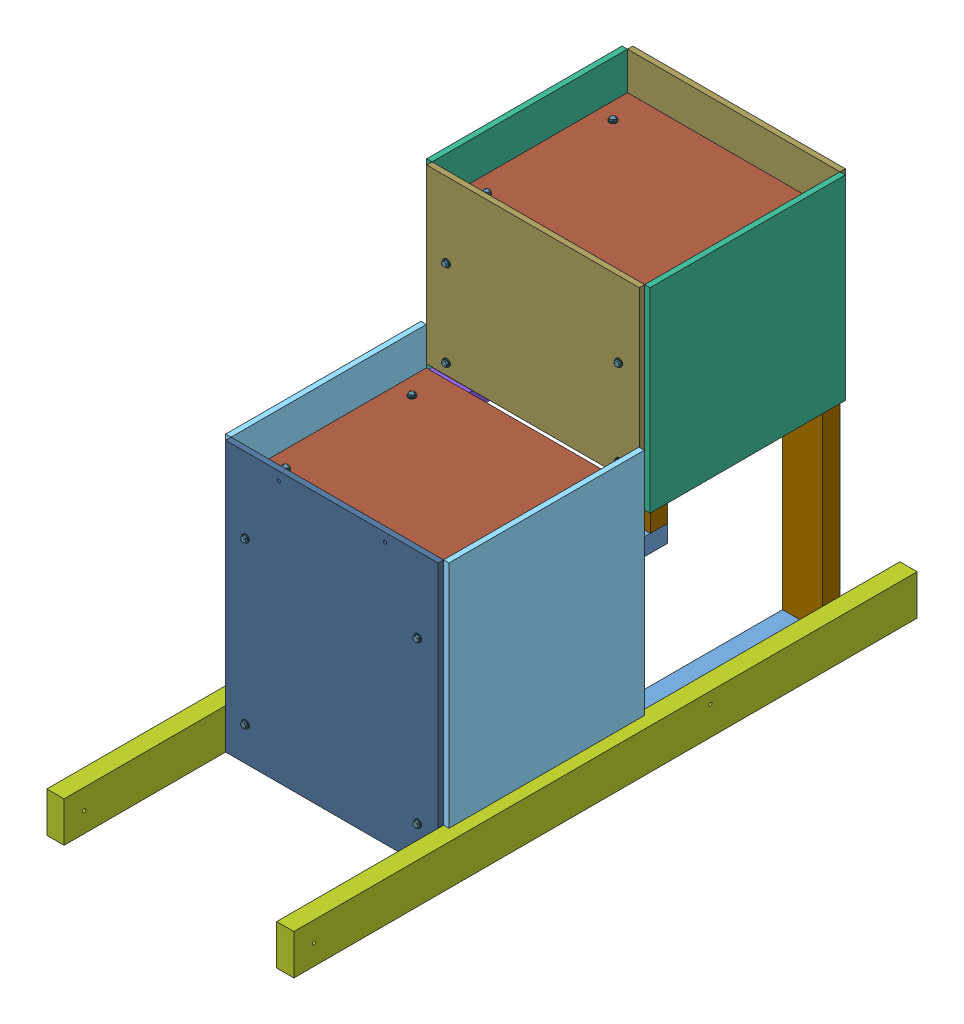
SolidWorks assembly TE-23004.SLDASM, configuration Default (file format 15000). Lengths in mm.
Overall size (546.1 901.7 1377.95).
85 component instances, 15 part files, 174 mates.
Components (placement in the parent):
- TE-23039-1: TE-23039.SLDASM [Default] at (0 0 0.0635) size (127 901.7 1377.95)
  - TE-23018-1: TE-23018.SLDPRT [Default] at (44.45 19.05 -0.0635) x (0 -1 0) z (0 0 1) size (38.1 88.9 876.3)
  - TE-23019-1: TE-23019.SLDPRT [Default] at (44.45 469.9 857.1865) x (0 0 -1) z (0 -1 0) size (38.1 88.9 431.8)
  - TE-23023-1: TE-23023.SLDPRT [Default] at (44.45 793.75 -0.0635) x (0 -1 0) z (0 0 1) size (38.1 88.9 431.8)
  - TE-23022-1: TE-23022.SLDPRT [Default] at (44.45 508 412.6865) x (0 0 1) z (0 1 0) size (38.1 88.9 266.7)
  - TE-23024-1: TE-23024.SLDPRT [Default] at (-11.9062 342.9 660.3365) x (0 0 -1) z (0 -1 0) size (431.8 11.91 508)
  - TE-23025-1: TE-23025.SLDPRT [Default] at (-11.9062 685.8 215.8365) x (0 0 1) z (0 1 0) size (431.8 11.91 431.8)
  - TE-23005-1: TE-23005.SLDPRT [Default] at (-19.05 44.45 -132.6198) size (38.1 88.9 1377.95)
  - TE-23021-1: TE-23021.SLDPRT [Default] at (44.45 488.95 38.0365) x (0 1 0) z (0 0 1) size (38.1 88.9 838.2)
  - TE-23020-1: TE-23020.SLDPRT [Default] at (44.45 38.1 18.9865) x (0 0 -1) z (0 1 0) size (38.1 88.9 736.6)
- TE-23038-1: TE-23038.SLDASM [Default] at (0 0 0.0635) size (127 901.7 1377.95)
  - TE-23018-1: TE-23018.SLDPRT [Default] at (425.45 19.05 -0.0635) x (0 -1 0) z (0 0 1) size (38.1 88.9 876.3)
  - TE-23019-1: TE-23019.SLDPRT [Default] at (425.45 38.1 857.1865) x (0 0 -1) z (0 1 0) size (38.1 88.9 431.8)
  - TE-23023-1: TE-23023.SLDPRT [Default] at (425.45 793.75 -0.0635) x (0 -1 0) z (0 0 1) size (38.1 88.9 431.8)
  - TE-23022-1: TE-23022.SLDPRT [Default] at (425.45 508 412.6865) x (0 0 1) z (0 1 0) size (38.1 88.9 266.7)
  - TE-23024-1: TE-23024.SLDPRT [Default] at (481.8062 342.9 660.3365) x (0 0 1) z (0 -1 0) size (431.8 11.91 508)
  - TE-23025-1: TE-23025.SLDPRT [Default] at (481.8062 685.8 215.8365) x (0 0 1) z (0 -1 0) size (431.8 11.91 431.8)
  - TE-23005-1: TE-23005.SLDPRT [Default] at (488.95 44.45 -132.6198) size (38.1 88.9 1377.95)
  - TE-23021-1: TE-23021.SLDPRT [Default] at (425.45 488.95 38.0365) x (0 1 0) z (0 0 1) size (38.1 88.9 838.2)
  - TE-23020-1: TE-23020.SLDPRT [Default] at (425.45 38.1 18.9865) x (0 0 -1) z (0 1 0) size (38.1 88.9 736.6)
- TE-23026-1: TE-23026.SLDPRT [Default] at (234.95 298.45 876.3) x (1 0 0) z (0 -1 0) size (469.9 11.91 596.9)
- TE-23027-1: TE-23027.SLDPRT [Default] at (234.95 508 660.4) size (457.2 11.91 419.1)
- TE-23028-1: TE-23028.SLDPRT [Default] at (234.95 711.2 431.8) size (469.9 381 11.91)
- TE-23028-2: TE-23028.SLDPRT [Default] at (234.95 711.2 -11.9062) size (469.9 381 11.91)
- TE-23027-2: TE-23027.SLDPRT [Default] at (234.95 812.8 215.9) size (457.2 11.91 419.1)
- TeeNut_.25_20-1: TeeNut_.25_20.SLDPRT [90975A025] at (425.45 736.6 392.5062) x (1 0 0) z (0 -1 0) size (19.05 9.53 19.05)
- TeeNut_.25_20-2: TeeNut_.25_20.SLDPRT [90975A025] at (425.45 546.1 392.5062) x (0.987351 0.158553 0) z (0.158553 -0.987351 0) size (19.05 9.53 19.05)
- TeeNut_.25_20-4: TeeNut_.25_20.SLDPRT [90975A025] at (425.45 773.5062 355.6) x (-0.994177 0 -0.107761) z (0.107761 0 -0.994177) size (19.05 9.53 19.05)
- TeeNut_.25_20-6: TeeNut_.25_20.SLDPRT [90975A025] at (425.45 773.5062 76.2) x (-0.972467 0 -0.233039) z (0.233039 0 -0.972467) size (19.05 9.53 19.05)
- TeeNut_.25_20-8: TeeNut_.25_20.SLDPRT [90975A025] at (425.45 736.6 39.2938) x (-0.642788 0.766044 0) z (-0.766044 -0.642788 0) size (19.05 9.53 19.05)
- TeeNut_.25_20-10: TeeNut_.25_20.SLDPRT [90975A025] at (425.45 468.7062 520.7) x (-0.089543 0 -0.995983) z (0.995983 0 -0.089543) size (19.05 9.53 19.05)
- TeeNut_.25_20-12: TeeNut_.25_20.SLDPRT [90975A025] at (425.45 468.7062 800.1) x (-0.194284 0 -0.980945) z (0.980945 0 -0.194284) size (19.05 9.53 19.05)
- TeeNut_.25_20-14: TeeNut_.25_20.SLDPRT [90975A025] at (425.45 431.8 837.0062) x (0.939693 0.34202 0) z (0.34202 -0.939693 0) size (19.05 9.53 19.05)
- TeeNut_.25_20-16: TeeNut_.25_20.SLDPRT [90975A025] at (425.45 76.2 837.0062) x (0.984808 0.173648 0) z (0.173648 -0.984808 0) size (19.05 9.53 19.05)
- TeeNut_.25_20-18: TeeNut_.25_20.SLDPRT [90975A025] at (44.45 76.2 837.0062) x (1 0 0) z (0 -1 0) size (19.05 9.53 19.05)
- TeeNut_.25_20-20: TeeNut_.25_20.SLDPRT [90975A025] at (44.45 431.8 837.0062) x (0.984808 -0.173648 0) z (-0.173648 -0.984808 0) size (19.05 9.53 19.05)
- TeeNut_.25_20-22: TeeNut_.25_20.SLDPRT [90975A025] at (44.45 468.7062 800.1) x (0.430036 0 -0.902812) z (0.902812 0 0.430036) size (19.05 9.53 19.05)
- TeeNut_.25_20-24: TeeNut_.25_20.SLDPRT [90975A025] at (44.45 468.7062 520.7) x (0.645562 0 -0.763708) z (0.763708 0 0.645562) size (19.05 9.53 19.05)
- TeeNut_.25_20-26: TeeNut_.25_20.SLDPRT [90975A025] at (44.45 546.1 392.5062) x (0.902849 -0.429957 0) z (-0.429957 -0.902849 0) size (19.05 9.53 19.05)
- TeeNut_.25_20-28: TeeNut_.25_20.SLDPRT [90975A025] at (44.45 736.6 392.5062) x (0.906989 -0.421154 0) z (-0.421154 -0.906989 0) size (19.05 9.53 19.05)
- TeeNut_.25_20-30: TeeNut_.25_20.SLDPRT [90975A025] at (44.45 773.5062 355.6) x (-0.404582 0 -0.914502) z (0.914502 0 -0.404582) size (19.05 9.53 19.05)
- TeeNut_.25_20-32: TeeNut_.25_20.SLDPRT [90975A025] at (44.45 773.5062 76.2) x (-0.712248 0 -0.701928) z (0.701928 0 -0.712248) size (19.05 9.53 19.05)
- TeeNut_.25_20-34: TeeNut_.25_20.SLDPRT [90975A025] at (44.45 736.6 39.2938) x (-0.173648 -0.984808 0) z (0.984808 -0.173648 0) size (19.05 9.53 19.05)
- TeeNut_.25_20-36: TeeNut_.25_20.SLDPRT [90975A025] at (44.45 546.1 39.2938) x (-0.923728 -0.383049 0) z (0.383049 -0.923728 0) size (19.05 9.53 19.05)
- TeeNut_.25_20-38: TeeNut_.25_20.SLDPRT [90975A025] at (425.45 546.1 39.2938) x (0.173648 -0.984808 0) z (0.984808 0.173648 0) size (19.05 9.53 19.05)
- hex_.25_20_2-2: hex_.25_20_2.SLDPRT [Default] at (425.45 546.1 9.4774) x (0 0 1) z (-0.763011 -0.646385 0) size (54.77 12.83 11.11)
- hex_.25_20_2-3: hex_.25_20_2.SLDPRT [Default] at (425.45 736.6 9.4774) x (0 0 1) z (0.496833 0.867846 0) size (54.77 12.83 11.11)
- hex_.25_20_2-4: hex_.25_20_2.SLDPRT [Default] at (44.45 546.1 9.4774) x (0 0 1) z (-0.44479 -0.895635 0) size (54.77 12.83 11.11)
- hex_.25_20_2-5: hex_.25_20_2.SLDPRT [Default] at (44.45 803.3226 76.2) x (0 -1 0) z (-0.809763 0 0.586757) size (54.77 12.83 11.11)
- hex_.25_20_2-6: hex_.25_20_2.SLDPRT [Default] at (425.45 431.8 866.8226) x (0 0 -1) z (-0.990347 -0.138607 0) size (54.77 12.83 11.11)
- hex_.25_20_2-7: hex_.25_20_2.SLDPRT [Default] at (425.45 76.2 866.8226) x (0 0 -1) z (0.745154 -0.666893 0) size (54.77 12.83 11.11)
- hex_.25_20_2-8: hex_.25_20_2.SLDPRT [Default] at (425.45 803.3226 76.2) x (0 -1 0) z (-0.954468 0 0.298314) size (54.77 12.83 11.11)
- hex_.25_20_2-9: hex_.25_20_2.SLDPRT [Default] at (44.45 76.2 866.8226) x (0 0 -1) z (-0.848403 -0.52935 0) size (54.77 12.83 11.11)
- hex_.25_20_2-10: hex_.25_20_2.SLDPRT [Default] at (44.45 431.8 866.8226) x (0 0 -1) z (0.285323 0.958431 0) size (54.77 12.83 11.11)
- hex_.25_20_2-11: hex_.25_20_2.SLDPRT [Default] at (425.45 498.5226 520.7) x (0 -1 0) z (0.273056 0 0.961998) size (54.77 12.83 11.11)
- hex_.25_20_2-12: hex_.25_20_2.SLDPRT [Default] at (425.45 498.5226 800.1) x (0 -1 0) z (-0.907887 0 0.419215) size (54.77 12.83 11.11)
- hex_.25_20_2-13: hex_.25_20_2.SLDPRT [Default] at (44.45 803.3226 355.6) x (0 -1 0) z (0.603096 0 0.797669) size (54.77 12.83 11.11)
- hex_.25_20_2-15: hex_.25_20_2.SLDPRT [Default] at (425.45 546.1 422.3226) x (0 0 -1) z (0.807696 -0.5896 0) size (54.77 12.83 11.11)
- hex_.25_20_2-16: hex_.25_20_2.SLDPRT [Default] at (44.45 498.5226 800.1) x (0 -1 0) z (0.961687 0 0.274151) size (54.77 12.83 11.11)
- hex_.25_20_2-17: hex_.25_20_2.SLDPRT [Default] at (44.45 498.5226 520.7) x (0 -1 0) z (-0.90705 0 0.421023) size (54.77 12.83 11.11)
- hex_.25_20_2-18: hex_.25_20_2.SLDPRT [Default] at (44.45 546.1 422.3226) x (0 0 -1) z (0.948389 -0.31711 0) size (54.77 12.83 11.11)
- hex_.25_20_2-19: hex_.25_20_2.SLDPRT [Default] at (425.45 803.3226 355.6) x (0 -1 0) z (-0.287086 0 0.957905) size (54.77 12.83 11.11)
- hex_.25_20_2-20: hex_.25_20_2.SLDPRT [Default] at (44.45 736.6 422.3226) x (0 0 -1) z (1 0 0) size (54.77 12.83 11.11)
- hex_.25_20_2-1: hex_.25_20_2.SLDPRT [Default] at (425.45 736.6 422.3226) x (0 0 -1) z (-0.132102 0.991236 0) size (54.77 12.83 11.11)
- washer_flat_.25-1: washer_flat_.25.SLDPRT [98023A029] at (425.45 736.6 -13.9383) x (1 0 0) z (0 -1 0) size (15.88 2.03 15.88)
- washer_flat_.25-2: washer_flat_.25.SLDPRT [98023A029] at (425.45 521.9383 520.7) x (-0.837169 0 -0.546944) z (-0.546944 0 0.837169) size (15.88 2.03 15.88)
- washer_flat_.25-3: washer_flat_.25.SLDPRT [98023A029] at (425.45 521.9383 800.1) x (-0.837169 0 -0.546944) z (-0.546944 0 0.837169) size (15.88 2.03 15.88)
- washer_flat_.25-4: washer_flat_.25.SLDPRT [98023A029] at (44.45 826.7382 355.6) x (-0.837169 0 -0.546944) z (-0.546944 0 0.837169) size (15.88 2.03 15.88)
- washer_flat_.25-5: washer_flat_.25.SLDPRT [98023A029] at (44.45 521.9383 520.7) x (-0.837169 0 -0.546944) z (-0.546944 0 0.837169) size (15.88 2.03 15.88)
- washer_flat_.25-6: washer_flat_.25.SLDPRT [98023A029] at (44.45 431.8 890.2382) x (1 0 0) z (0 1 0) size (15.88 2.03 15.88)
- washer_flat_.25-7: washer_flat_.25.SLDPRT [98023A029] at (425.45 736.6 445.7382) x (0.995174 0.098126 0) z (-0.098126 0.995174 0) size (15.88 2.03 15.88)
- washer_flat_.25-8: washer_flat_.25.SLDPRT [98023A029] at (425.45 826.7382 76.2) x (-0.837169 0 -0.546944) z (-0.546944 0 0.837169) size (15.88 2.03 15.88)
- washer_flat_.25-9: washer_flat_.25.SLDPRT [98023A029] at (44.45 826.7382 76.2) x (-0.837169 0 -0.546944) z (-0.546944 0 0.837169) size (15.88 2.03 15.88)
- washer_flat_.25-10: washer_flat_.25.SLDPRT [98023A029] at (425.45 546.1 -13.9383) x (1 0 0) z (0 -1 0) size (15.88 2.03 15.88)
- washer_flat_.25-11: washer_flat_.25.SLDPRT [98023A029] at (44.45 546.1 -13.9383) x (1 0 0) z (0 -1 0) size (15.88 2.03 15.88)
- washer_flat_.25-12: washer_flat_.25.SLDPRT [98023A029] at (44.45 736.6 -13.9383) x (1 0 0) z (0 -1 0) size (15.88 2.03 15.88)
- washer_flat_.25-13: washer_flat_.25.SLDPRT [98023A029] at (425.45 431.8 890.2382) x (1 0 0) z (0 1 0) size (15.88 2.03 15.88)
- washer_flat_.25-14: washer_flat_.25.SLDPRT [98023A029] at (44.45 521.9383 800.1) x (-0.837169 0 -0.546944) z (-0.546944 0 0.837169) size (15.88 2.03 15.88)
- washer_flat_.25-15: washer_flat_.25.SLDPRT [98023A029] at (44.45 76.2 890.2382) x (1 0 0) z (0 1 0) size (15.88 2.03 15.88)
- washer_flat_.25-16: washer_flat_.25.SLDPRT [98023A029] at (425.45 826.7382 355.6) x (-0.837169 0 -0.546944) z (-0.546944 0 0.837169) size (15.88 2.03 15.88)
- washer_flat_.25-17: washer_flat_.25.SLDPRT [98023A029] at (425.45 76.2 890.2382) x (1 0 0) z (0 1 0) size (15.88 2.03 15.88)
- washer_flat_.25-18: washer_flat_.25.SLDPRT [98023A029] at (425.45 546.1 445.7382) x (0.860134 -0.510068 0) z (0.510068 0.860134 0) size (15.88 2.03 15.88)
- washer_flat_.25-19: washer_flat_.25.SLDPRT [98023A029] at (44.45 546.1 445.7382) x (1 0 0) z (0 1 0) size (15.88 2.03 15.88)
- washer_flat_.25-20: washer_flat_.25.SLDPRT [98023A029] at (44.45 736.6 445.7382) x (0.975112 0.221713 0) z (-0.221713 0.975112 0) size (15.88 2.03 15.88)
- hex_.25_20_2-21: hex_.25_20_2.SLDPRT [Default] at (44.45 736.6 9.4774) x (0 0 1) z (0.942994 -0.332808 0) size (54.77 12.83 11.11)
Mates (geometry in assembly coordinates):
- Distance5: distance = 6.35 mm anti-aligned: plane of TE-23026-1 through (234.95 298.45 876.3) normal (0 0 -1); plane of Cube Shelf Platform-1 through (6.35 519.9062 869.95) normal (0 0 1)
- Coincident83: coincident aligned: plane of Cube Shelf Upper Front Panel-1 through (0 901.7 443.7063) normal (0 1 0); plane of Cube Shelf Upper Front Panel-2 through (0 901.7 0) normal (0 1 0)
- Coincident159: coincident anti-aligned: plane of Cube Shelf Right Side Frame-1/Cube Shelf Long Horizontal-1 through (0 0 876.3) normal (0 -1 0)
- Coincident160: coincident anti-aligned: plane of Cube Shelf Right Side Frame-1/Cube Shelf Long Horizontal-1 through (0 38.1 876.3) normal (-1 0 0)
- Coincident161: coincident anti-aligned: plane of Cube Shelf Right Side Frame-1/Cube Shelf Long Horizontal-1 through (44.45 19.05 0) normal (0 0 -1)
- Coincident162: coincident aligned: plane of Cube Shelf Right Side Frame-1/Cube Shelf Long Horizontal-1 through (0 0 876.3) normal (0 -1 0); plane of TE-23026-1 through (0 0 888.2062) normal (0 -1 0)
- Coincident163: coincident anti-aligned: plane of TE-23039-1/TE-23019-1 through (0 38.1 876.3) normal (0 0 1); plane of TE-23026-1 through (234.95 298.45 876.3) normal (0 0 -1)
- Coincident164: coincident aligned: plane of TE-23039-1/TE-23019-1 through (0 38.1 876.3) normal (-1 0 0); plane of TE-23026-1 through (0 0 888.2062) normal (-1 0 0)
- Distance12: distance = 6.35 mm anti-aligned: plane of Cube Shelf Platform-1 through (6.35 519.9062 869.95) normal (-1 0 0); plane of TE-23039-1/TE-23024-1 through (0 342.9 660.4) normal (1 0 0)
- Coincident166: coincident aligned: plane of Cube Shelf Upper Front Panel-1 through (0 901.7 443.7063) normal (0 1 0); plane of TE-23039-1/TE-23025-1 through (0 901.7 0) normal (0 1 0)
- Coincident167: coincident anti-aligned: plane of Cube Shelf Upper Front Panel-2 through (234.95 711.2 0) normal (0 0 1); plane of TE-23039-1/TE-23025-1 through (0 901.7 0) normal (0 0 -1)
- Coincident168: coincident anti-aligned: plane of Cube Shelf Upper Front Panel-1 through (234.95 711.2 431.8) normal (0 0 -1); plane of TE-23039-1/TE-23025-1 through (0 901.7 431.8) normal (0 0 1)
- Coincident181: coincident aligned: plane of Assem7^Cube Shelf-1/Copy of Assem6^Assem7_Cube Shelf-1/Cube Shelf Long Horizontal-1 through (381 0 876.3) normal (0 -1 0); plane of TE-23026-1 through (0 0 888.2062) normal (0 -1 0)
- Coincident182: coincident anti-aligned: plane of Assem7^Cube Shelf-1/Copy of Assem6^Assem7_Cube Shelf-1/Cube Shelf Long Vertical-1 through (469.9 482.6 876.3) normal (0 0 1); plane of TE-23026-1 through (234.95 298.45 876.3) normal (0 0 -1)
- Coincident183: coincident aligned: plane of Assem7^Cube Shelf-1/Copy of Assem6^Assem7_Cube Shelf-1/Cube Shelf Short Horizontal-1 through (469.9 812.8 431.8) normal (1 0 0); plane of Cube Shelf Upper Front Panel-2 through (469.9 520.7 0) normal (1 0 0)
- Coincident184: coincident anti-aligned: plane of Assem7^Cube Shelf-1/Copy of Assem6^Assem7_Cube Shelf-1/Cube Shelf Short Horizontal-1 through (381 812.8 431.8) normal (0 1 0); plane of GE-23651-2 through (234.95 812.8 215.9) normal (0 -1 0)
- Concentric5: concentric anti-aligned: cylinder of Assem7^Cube Shelf-1/Copy of Assem6^Assem7_Cube Shelf-1/Cube Shelf Short Horizontal-1 through (425.45 774.7 76.2) axis (0 -1 0) radius 3.9688; cylinder of GE-23651-2 through (425.45 824.7062 76.2) axis (0 1 0) radius 3.5719
- Coincident185: coincident anti-aligned: plane of Assem7^Cube Shelf-1/Copy of Assem6^Assem7_Cube Shelf-1/Cube Shelf Short Vertical-1 through (381 774.7 431.8) normal (0 0 1); plane of Cube Shelf Upper Front Panel-1 through (234.95 711.2 431.8) normal (0 0 -1)
- Coincident186: coincident aligned: plane of Assem7^Cube Shelf-1/Copy of Assem6^Assem7_Cube Shelf-1/Cube Shelf Short Vertical-1 through (469.9 774.7 393.7) normal (1 0 0); plane of Cube Shelf Upper Front Panel-1 through (469.9 520.7 443.7063) normal (1 0 0)
- Coincident187: coincident anti-aligned: plane of Cube Shelf Upper Front Panel-1 through (234.95 711.2 443.7063) normal (0 0 1); plane of Assem7^Cube Shelf-1/Copy of Assem6^Assem7_Cube Shelf-1/Cube Shelf Lower Side Panel-1 through (469.9 88.9 443.7063) normal (0 0 -1)
- Coincident188: coincident aligned: plane of Cube Shelf Upper Front Panel-2 through (0 901.7 0) normal (0 1 0); plane of Assem7^Cube Shelf-1/Copy of Assem6^Assem7_Cube Shelf-1/Cube Shelf Upper Side Panel-1 through (469.9 901.7 0) normal (0 1 0)
- Coincident189: coincident anti-aligned: plane of Cube Shelf Upper Front Panel-2 through (234.95 711.2 0) normal (0 0 1); plane of Assem7^Cube Shelf-1/Copy of Assem6^Assem7_Cube Shelf-1/Cube Shelf Upper Side Panel-1 through (469.9 482.6 0) normal (0 0 -1)
- Coincident190: coincident anti-aligned: plane of TE-23026-1 through (469.9 0 888.2062) normal (1 0 0); plane of Assem7^Cube Shelf-1/Copy of Assem6^Assem7_Cube Shelf-1/Cone Ramp Horizontal no holes-1 through (469.9 0 1245.3302) normal (-1 0 0)
- Concentric7: concentric anti-aligned: cylinder of Cube Shelf Left Side Frame-1/Copy of Assem6^Cube Shelf Left Side Frame-1/Cube Shelf Short Vertical-1 through (425.45 736.6 431.8) axis (0 0 1) radius 3.9688; cylinder of TeeNut_.25_20-1 through (425.45 736.6 401.6375) axis (0 0 -1) radius 3.8735
- Coincident191: coincident anti-aligned: plane of Cube Shelf Left Side Frame-1/Copy of Assem6^Cube Shelf Left Side Frame-1/Cube Shelf Short Vertical-1 through (381 774.7 393.7) normal (0 0 -1); plane of TeeNut_.25_20-1 through (425.45 736.6 393.7) normal (0 0 1)
- Coincident192: coincident anti-aligned: plane of Cube Shelf Left Side Frame-1/Copy of Assem6^Cube Shelf Left Side Frame-1/Cube Shelf Long Horizontal top-1 through (469.9 520.7 876.3) normal (0 1 0); plane of TE-23027-1 through (234.95 508 660.4) normal (0 -1 0)
- Concentric8: concentric anti-aligned: cylinder of Cube Shelf Left Side Frame-1/Copy of Assem6^Cube Shelf Left Side Frame-1/Cube Shelf Short Vertical-1 through (425.45 558.8 431.8) axis (0 0 1) radius 3.9688; cylinder of TeeNut_.25_20-2 through (425.45 546.1 401.6375) axis (0 0 -1) radius 3.8735
- Coincident193: coincident anti-aligned: plane of Cube Shelf Left Side Frame-1/Copy of Assem6^Cube Shelf Left Side Frame-1/Cube Shelf Short Vertical-1 through (381 774.7 393.7) normal (0 0 -1); plane of TeeNut_.25_20-2 through (425.45 546.1 393.7) normal (0 0 1)
- Concentric9: concentric aligned: cylinder of Cube Shelf Left Side Frame-1/Copy of Assem6^Cube Shelf Left Side Frame-1/Cube Shelf Short Horizontal-1 through (425.45 774.7 355.6) axis (0 -1 0) radius 3.9688; cylinder of TeeNut_.25_20-4 through (425.45 782.6375 355.6) axis (0 -1 0) radius 3.8735
- Coincident194: coincident anti-aligned: plane of Cube Shelf Left Side Frame-1/Copy of Assem6^Cube Shelf Left Side Frame-1/Cube Shelf Short Horizontal-1 through (381 774.7 431.8) normal (0 -1 0); plane of TeeNut_.25_20-4 through (425.45 774.7 355.6) normal (0 1 0)
- Concentric10: concentric aligned: cylinder of Cube Shelf Left Side Frame-1/Copy of Assem6^Cube Shelf Left Side Frame-1/Cube Shelf Short Horizontal-1 through (425.45 774.7 76.2) axis (0 -1 0) radius 3.9688; cylinder of TeeNut_.25_20-6 through (425.45 782.6375 76.2) axis (0 -1 0) radius 3.8735
- Coincident195: coincident anti-aligned: plane of Cube Shelf Left Side Frame-1/Copy of Assem6^Cube Shelf Left Side Frame-1/Cube Shelf Short Horizontal-1 through (381 774.7 431.8) normal (0 -1 0); plane of TeeNut_.25_20-6 through (425.45 774.7 76.2) normal (0 1 0)
- Concentric11: concentric anti-aligned: cylinder of Cube Shelf Left Side Frame-1/Copy of Assem6^Cube Shelf Left Side Frame-1/Back CS uprights-1 through (425.45 736.6 0) axis (0 0 -1) radius 3.9688; cylinder of TeeNut_.25_20-8 through (425.45 736.6 30.1625) axis (0 0 1) radius 3.8735
- Coincident196: coincident anti-aligned: plane of Cube Shelf Left Side Frame-1/Copy of Assem6^Cube Shelf Left Side Frame-1/Back CS uprights-1 through (469.9 774.7 38.1) normal (0 0 1); plane of TeeNut_.25_20-8 through (425.45 736.6 38.1) normal (0 0 -1)
- Concentric12: concentric anti-aligned: cylinder of Cube Shelf Left Side Frame-1/Copy of Assem6^Cube Shelf Left Side Frame-1/Cube Shelf Long Horizontal top-1 through (425.45 520.7 520.7) axis (0 1 0) radius 3.9688; cylinder of TeeNut_.25_20-10 through (425.45 477.8375 520.7) axis (0 -1 0) radius 3.8735
- Coincident197: coincident anti-aligned: plane of Cube Shelf Left Side Frame-1/Copy of Assem6^Cube Shelf Left Side Frame-1/Cube Shelf Long Horizontal top-1 through (469.9 482.6 876.3) normal (0 -1 0); plane of TeeNut_.25_20-10 through (425.45 469.9 520.7) normal (0 1 0)
- Concentric13: concentric anti-aligned: cylinder of Cube Shelf Left Side Frame-1/Copy of Assem6^Cube Shelf Left Side Frame-1/Cube Shelf Long Horizontal top-1 through (425.45 520.7 800.1) axis (0 1 0) radius 3.9688; cylinder of TeeNut_.25_20-12 through (425.45 477.8375 800.1) axis (0 -1 0) radius 3.8735
- Coincident198: coincident anti-aligned: plane of Cube Shelf Left Side Frame-1/Copy of Assem6^Cube Shelf Left Side Frame-1/Cube Shelf Long Horizontal top-1 through (469.9 482.6 876.3) normal (0 -1 0); plane of TeeNut_.25_20-12 through (425.45 469.9 800.1) normal (0 1 0)
- Concentric14: concentric aligned: cylinder of Cube Shelf Left Side Frame-1/Copy of Assem6^Cube Shelf Left Side Frame-1/Cube Shelf Long Vertical-1 through (425.45 444.5 838.2) axis (0 0 -1) radius 3.9688; cylinder of TeeNut_.25_20-14 through (425.45 431.8 846.1375) axis (0 0 -1) radius 3.8735
- Coincident199: coincident anti-aligned: plane of Cube Shelf Left Side Frame-1/Copy of Assem6^Cube Shelf Left Side Frame-1/Cube Shelf Long Vertical-1 through (469.9 482.6 838.2) normal (0 0 -1); plane of TeeNut_.25_20-14 through (425.45 431.8 838.2) normal (0 0 1)
- Concentric15: concentric aligned: cylinder of Cube Shelf Left Side Frame-1/Copy of Assem6^Cube Shelf Left Side Frame-1/Cube Shelf Long Vertical-1 through (425.45 76.2 838.2) axis (0 0 -1) radius 3.9688; cylinder of TeeNut_.25_20-16 through (425.45 76.2 846.1375) axis (0 0 -1) radius 3.8735
- Coincident200: coincident anti-aligned: plane of Cube Shelf Left Side Frame-1/Copy of Assem6^Cube Shelf Left Side Frame-1/Cube Shelf Long Vertical-1 through (469.9 482.6 838.2) normal (0 0 -1); plane of TeeNut_.25_20-16 through (425.45 76.2 838.2) normal (0 0 1)
- Concentric16: concentric aligned: cylinder of TE-23039-1/TE-23019-1 through (44.45 76.2 838.2) axis (0 0 -1) radius 3.9688; cylinder of TeeNut_.25_20-18 through (44.45 76.2 846.1375) axis (0 0 -1) radius 3.8735
- Coincident201: coincident anti-aligned: plane of TE-23039-1/TE-23019-1 through (0 38.1 838.2) normal (0 0 -1); plane of TeeNut_.25_20-18 through (44.45 76.2 838.2) normal (0 0 1)
- Concentric17: concentric aligned: cylinder of TE-23039-1/TE-23019-1 through (44.45 431.8 838.2) axis (0 0 -1) radius 3.9688; cylinder of TeeNut_.25_20-20 through (44.45 431.8 846.1375) axis (0 0 -1) radius 3.8735
- Coincident202: coincident anti-aligned: plane of TE-23039-1/TE-23019-1 through (0 38.1 838.2) normal (0 0 -1); plane of TeeNut_.25_20-20 through (44.45 431.8 838.2) normal (0 0 1)
- Concentric18: concentric anti-aligned: cylinder of TE-23039-1/TE-23021-1 through (44.45 508 800.1) axis (0 1 0) radius 3.9688; cylinder of TeeNut_.25_20-22 through (44.45 477.8375 800.1) axis (0 -1 0) radius 3.8735
- Coincident203: coincident anti-aligned: plane of TE-23039-1/TE-23021-1 through (88.9 469.9 876.3) normal (0 -1 0); plane of TeeNut_.25_20-22 through (44.45 469.9 800.1) normal (0 1 0)
- Concentric19: concentric anti-aligned: cylinder of TE-23039-1/TE-23021-1 through (44.45 508 520.7) axis (0 1 0) radius 3.9688; cylinder of TeeNut_.25_20-24 through (44.45 477.8375 520.7) axis (0 -1 0) radius 3.8735
- Coincident204: coincident anti-aligned: plane of TE-23039-1/TE-23021-1 through (88.9 469.9 876.3) normal (0 -1 0); plane of TeeNut_.25_20-24 through (44.45 469.9 520.7) normal (0 1 0)
- Concentric20: concentric anti-aligned: cylinder of TE-23039-1/TE-23022-1 through (44.45 546.1 431.8) axis (0 0 1) radius 3.9688; cylinder of TeeNut_.25_20-26 through (44.45 546.1 401.6375) axis (0 0 -1) radius 3.8735
- Coincident205: coincident anti-aligned: plane of TE-23039-1/TE-23022-1 through (0 774.7 393.7) normal (0 0 -1); plane of TeeNut_.25_20-26 through (44.45 546.1 393.7) normal (0 0 1)
- Concentric21: concentric anti-aligned: cylinder of TE-23039-1/TE-23022-1 through (44.45 736.6 431.8) axis (0 0 1) radius 3.9688; cylinder of TeeNut_.25_20-28 through (44.45 736.6 401.6375) axis (0 0 -1) radius 3.8735
- Coincident206: coincident anti-aligned: plane of TE-23039-1/TE-23022-1 through (0 774.7 393.7) normal (0 0 -1); plane of TeeNut_.25_20-28 through (44.45 736.6 393.7) normal (0 0 1)
- Concentric22: concentric aligned: cylinder of Cube Shelf Right Side Frame-1/Cube Shelf Short Horizontal-1 through (44.45 774.7 355.6) axis (0 -1 0) radius 3.9688; cylinder of TeeNut_.25_20-30 through (44.45 782.6375 355.6) axis (0 -1 0) radius 3.8735
- Coincident207: coincident anti-aligned: plane of Cube Shelf Right Side Frame-1/Cube Shelf Short Horizontal-1 through (0 774.7 431.8) normal (0 -1 0); plane of TeeNut_.25_20-30 through (44.45 774.7 355.6) normal (0 1 0)
- Concentric23: concentric aligned: cylinder of Cube Shelf Right Side Frame-1/Cube Shelf Short Horizontal-1 through (44.45 774.7 76.2) axis (0 -1 0) radius 3.9688; cylinder of TeeNut_.25_20-32 through (44.45 782.6375 76.2) axis (0 -1 0) radius 3.8735
- Coincident208: coincident anti-aligned: plane of Cube Shelf Right Side Frame-1/Cube Shelf Short Horizontal-1 through (0 774.7 431.8) normal (0 -1 0); plane of TeeNut_.25_20-32 through (44.45 774.7 76.2) normal (0 1 0)
- Concentric24: concentric anti-aligned: cylinder of Cube Shelf Right Side Frame-1/Back CS uprights-1 through (44.45 736.6 0) axis (0 0 -1) radius 3.9688; cylinder of TeeNut_.25_20-34 through (44.45 736.6 30.1625) axis (0 0 1) radius 3.8735
- Coincident209: coincident anti-aligned: plane of Cube Shelf Right Side Frame-1/Back CS uprights-1 through (88.9 774.7 38.1) normal (0 0 1); plane of TeeNut_.25_20-34 through (44.45 736.6 38.1) normal (0 0 -1)
- Concentric25: concentric anti-aligned: cylinder of Cube Shelf Right Side Frame-1/Back CS uprights-1 through (44.45 546.1 0) axis (0 0 -1) radius 3.9688; cylinder of TeeNut_.25_20-36 through (44.45 546.1 30.1625) axis (0 0 1) radius 3.8735
- Coincident210: coincident anti-aligned: plane of Cube Shelf Right Side Frame-1/Back CS uprights-1 through (88.9 774.7 38.1) normal (0 0 1); plane of TeeNut_.25_20-36 through (44.45 546.1 38.1) normal (0 0 -1)
- Concentric26: concentric anti-aligned: cylinder of Cube Shelf Left Side Frame-1/Copy of Assem6^Cube Shelf Left Side Frame-1/Back CS uprights-1 through (425.45 558.8 0) axis (0 0 -1) radius 3.9688; cylinder of TeeNut_.25_20-38 through (425.45 558.8 30.1625) axis (0 0 1) radius 3.8735
- Coincident211: coincident anti-aligned: plane of Cube Shelf Left Side Frame-1/Copy of Assem6^Cube Shelf Left Side Frame-1/Back CS uprights-1 through (469.9 774.7 38.1) normal (0 0 1); plane of TeeNut_.25_20-38 through (425.45 558.8 38.1) normal (0 0 -1)
- Coincident232: coincident anti-aligned: plane of TE-23038-1/TE-23021-1 through (469.9 508 876.3) normal (0 1 0); plane of TE-23027-1 through (234.95 508 660.4) normal (0 -1 0)
- Coincident233: coincident anti-aligned: plane of TE-23039-1/TE-23021-1 through (88.9 508 876.3) normal (0 1 0); plane of TE-23027-1 through (234.95 508 660.4) normal (0 -1 0)
- Coincident234: coincident anti-aligned: plane of TE-23039-1/TE-23025-1 through (0 685.8 215.9) normal (1 0 0); plane of Cube Shelf Upper Front Panel-1 through (0 520.7 443.7063) normal (-1 0 0)
- Coincident235: coincident anti-aligned: plane of Cube Shelf Right Side Frame-1/Cube Shelf Short Horizontal-1 through (0 812.8 431.8) normal (0 1 0); plane of GE-23651-2 through (234.95 812.8 215.9) normal (0 -1 0)
- Coincident237: coincident anti-aligned: plane of TE-23039-1/TE-23025-1 through (0 685.8 215.9) normal (1 0 0); plane of Cube Shelf Upper Front Panel-2 through (0 520.7 0) normal (-1 0 0)
- Coincident238: coincident aligned: plane of Cube Shelf Right Side Frame-1/Cone Ramp Horizontal no holes-1 through (-19.05 44.45 -132.5562) normal (0 0 -1); plane of Cube Shelf Left Side Frame-1/Cone Ramp Horizontal no holes-1 through (488.95 44.45 -132.5562) normal (0 0 -1)
- Coincident239: coincident aligned: plane of Cube Shelf Right Side Frame-1/Cone Ramp Horizontal no holes-1 through (-38.1 0 1245.3938) normal (0 -1 0); plane of Cube Shelf Left Side Frame-1/Cone Ramp Horizontal no holes-1 through (469.9 0 1245.3938) normal (0 -1 0)
- Coincident240: coincident anti-aligned: plane of TE-23038-1/TE-23024-1 through (469.9 342.9 660.4) normal (-1 0 0); plane of TE-23026-1 through (469.9 0 888.2062) normal (1 0 0)
- Concentric50: concentric anti-aligned: cylinder of Cube Shelf Left Side Frame-1/Back CS uprights-1 through (425.45 546.1 0) axis (0 0 -1) radius 3.9688; cylinder of TeeNut_.25_20-38 through (425.45 546.1 30.1625) axis (0 0 1) radius 3.8735
- Coincident241: coincident anti-aligned: plane of Cube Shelf Left Side Frame-1/Back CS uprights-1 through (469.9 774.7 38.1) normal (0 0 1); plane of TeeNut_.25_20-38 through (425.45 546.1 38.1) normal (0 0 -1)
- Concentric51: concentric anti-aligned: cylinder of TE-23038-1/TE-23022-1 through (425.45 736.6 431.8) axis (0 0 1) radius 3.9688; cylinder of TeeNut_.25_20-1 through (425.45 736.6 401.6375) axis (0 0 -1) radius 3.8735
- Coincident242: coincident anti-aligned: plane of TE-23038-1/TE-23022-1 through (381 774.7 393.7) normal (0 0 -1); plane of TeeNut_.25_20-1 through (425.45 736.6 393.7) normal (0 0 1)
- Concentric52: concentric anti-aligned: cylinder of TE-23038-1/TE-23022-1 through (425.45 546.1 431.8) axis (0 0 1) radius 3.9688; cylinder of TeeNut_.25_20-2 through (425.45 546.1 401.6375) axis (0 0 -1) radius 3.8735
- Coincident243: coincident anti-aligned: plane of TE-23038-1/TE-23022-1 through (381 774.7 393.7) normal (0 0 -1); plane of TeeNut_.25_20-2 through (425.45 546.1 393.7) normal (0 0 1)
- Concentric53: concentric aligned: cylinder of GE-23640-1/GE-23647-1 through (425.45 774.7 355.6) axis (0 -1 0) radius 3.9688; cylinder of TeeNut_.25_20-4 through (425.45 782.6375 355.6) axis (0 -1 0) radius 3.8735
- Coincident244: coincident anti-aligned: plane of GE-23640-1/GE-23647-1 through (381 774.7 431.8) normal (0 -1 0); circle of TeeNut_.25_20-4
- Concentric54: concentric aligned: cylinder of GE-23640-1/GE-23647-1 through (425.45 774.7 76.2) axis (0 -1 0) radius 3.9688; cylinder of TeeNut_.25_20-6 through (425.45 782.6375 76.2) axis (0 -1 0) radius 3.8735
- Coincident245: coincident anti-aligned: plane of GE-23640-1/GE-23647-1 through (381 774.7 431.8) normal (0 -1 0); circle of TeeNut_.25_20-6
- Concentric55: concentric anti-aligned: cylinder of GE-23640-1/GE-23644-1 through (425.45 736.6 0) axis (0 0 -1) radius 3.9688; cylinder of TeeNut_.25_20-8 through (425.45 736.6 30.1625) axis (0 0 1) radius 3.8735
- Coincident246: coincident anti-aligned: plane of GE-23640-1/GE-23644-1 through (469.9 774.7 38.1) normal (0 0 1); circle of TeeNut_.25_20-8
- Concentric56: concentric anti-aligned: cylinder of TE-23038-1/TE-23021-1 through (425.45 508 800.1) axis (0 1 0) radius 3.9688; cylinder of TeeNut_.25_20-12 through (425.45 477.8375 800.1) axis (0 -1 0) radius 3.8735
- Coincident247: coincident anti-aligned: plane of TE-23038-1/TE-23021-1 through (469.9 469.9 876.3) normal (0 -1 0); circle of TeeNut_.25_20-12
- Concentric57: concentric aligned: cylinder of TE-23038-1/TE-23019-1 through (425.45 431.8 838.2) axis (0 0 -1) radius 3.9688; cylinder of TeeNut_.25_20-14 through (425.45 431.8 846.1375) axis (0 0 -1) radius 3.8735
- Coincident248: coincident anti-aligned: plane of TE-23038-1/TE-23019-1 through (469.9 469.9 838.2) normal (0 0 -1); circle of TeeNut_.25_20-14
- Concentric58: concentric aligned: cylinder of TE-23038-1/TE-23019-1 through (425.45 76.2 838.2) axis (0 0 -1) radius 3.9688; cylinder of TeeNut_.25_20-16 through (425.45 76.2 846.1375) axis (0 0 -1) radius 3.8735
- Coincident249: coincident anti-aligned: plane of TE-23038-1/TE-23019-1 through (469.9 469.9 838.2) normal (0 0 -1); circle of TeeNut_.25_20-16
- Concentric59: concentric anti-aligned: cylinder of TE-23038-1/TE-23021-1 through (425.45 508 520.7) axis (0 1 0) radius 3.9688; cylinder of TeeNut_.25_20-10 through (425.45 477.8375 520.7) axis (0 -1 0) radius 3.8735
- Coincident250: coincident anti-aligned: plane of TE-23038-1/TE-23021-1 through (469.9 469.9 876.3) normal (0 -1 0); circle of TeeNut_.25_20-10
- Concentric60: concentric anti-aligned: cylinder of GE-23652-1 through (44.45 736.6 443.7063) axis (0 0 1) radius 3.5719; cylinder of hex_.25_20_2-20 through (44.45 736.6 445.7382) axis (0 0 -1) radius 3.175
- Concentric61: concentric anti-aligned: cylinder of GE-23652-1 through (44.45 736.6 443.7063) axis (0 0 1) radius 3.5719; cylinder of washer_flat_.25-20 through (44.45 736.6 445.7382) axis (0 0 -1) radius 3.5687
- Coincident252: coincident anti-aligned: plane of GE-23652-1 through (234.95 711.2 443.7063) normal (0 0 1); circle of washer_flat_.25-20
- Coincident253: coincident anti-aligned: plane of hex_.25_20_2-20 through (50.0063 739.8079 445.7382) normal (0 0 -1); plane of washer_flat_.25-20 through (44.45 736.6 445.7382) normal (0 0 1)
- Concentric62: concentric anti-aligned: cylinder of GE-23652-1 through (425.45 736.6 443.7063) axis (0 0 1) radius 3.5719; cylinder of washer_flat_.25-7 through (425.45 736.6 445.7382) axis (0 0 -1) radius 3.5687
- Coincident254: coincident anti-aligned: plane of GE-23652-1 through (234.95 711.2 443.7063) normal (0 0 1); plane of washer_flat_.25-7 through (425.45 736.6 443.7063) normal (0 0 -1)
- Concentric63: concentric anti-aligned: cylinder of GE-23652-1 through (44.45 546.1 443.7063) axis (0 0 1) radius 3.5719; cylinder of washer_flat_.25-19 through (44.45 546.1 445.7382) axis (0 0 -1) radius 3.5687
- Coincident255: coincident anti-aligned: plane of GE-23652-1 through (234.95 711.2 443.7063) normal (0 0 1); circle of washer_flat_.25-19
- Concentric64: concentric anti-aligned: cylinder of GE-23652-1 through (425.45 546.1 443.7063) axis (0 0 1) radius 3.5719; cylinder of washer_flat_.25-18 through (425.45 546.1 445.7382) axis (0 0 -1) radius 3.5687
- Coincident256: coincident anti-aligned: plane of GE-23652-1 through (234.95 711.2 443.7063) normal (0 0 1); circle of washer_flat_.25-18
- Coincident257: coincident anti-aligned: plane of TE-23026-1 through (234.95 298.45 888.2062) normal (0 0 1); plane of washer_flat_.25-6 through (44.45 431.8 888.2062) normal (0 0 -1)
- Coincident258: coincident anti-aligned: plane of TE-23026-1 through (234.95 298.45 888.2062) normal (0 0 1); plane of washer_flat_.25-17 through (425.45 76.2 888.2062) normal (0 0 -1)
- Coincident259: coincident anti-aligned: plane of TE-23026-1 through (234.95 298.45 888.2062) normal (0 0 1); plane of washer_flat_.25-13 through (425.45 431.8 888.2062) normal (0 0 -1)
- Coincident260: coincident anti-aligned: plane of TE-23026-1 through (234.95 298.45 888.2062) normal (0 0 1); plane of washer_flat_.25-15 through (44.45 76.2 888.2062) normal (0 0 -1)
- Concentric65: concentric anti-aligned: cylinder of TE-23026-1 through (44.45 431.8 888.2062) axis (0 0 1) radius 3.5719; cylinder of washer_flat_.25-6 through (44.45 431.8 890.2382) axis (0 0 -1) radius 3.5687
- Concentric66: concentric anti-aligned: cylinder of TE-23026-1 through (425.45 431.8 888.2062) axis (0 0 1) radius 3.5719; cylinder of washer_flat_.25-13 through (425.45 431.8 890.2382) axis (0 0 -1) radius 3.5687
- Concentric67: concentric anti-aligned: cylinder of TE-23026-1 through (44.45 76.2 888.2062) axis (0 0 1) radius 3.5719; cylinder of washer_flat_.25-15 through (44.45 76.2 890.2382) axis (0 0 -1) radius 3.5687
- Concentric68: concentric anti-aligned: cylinder of TE-23026-1 through (425.45 76.2 888.2062) axis (0 0 1) radius 3.5719; cylinder of washer_flat_.25-17 through (425.45 76.2 890.2382) axis (0 0 -1) radius 3.5687
- Coincident261: coincident anti-aligned: plane of GE-23652-2 through (234.95 711.2 -11.9062) normal (0 0 -1); plane of washer_flat_.25-1 through (425.45 736.6 -11.9062) normal (0 0 1)
- Coincident262: coincident anti-aligned: plane of GE-23652-2 through (234.95 711.2 -11.9062) normal (0 0 -1); plane of washer_flat_.25-12 through (44.45 736.6 -11.9062) normal (0 0 1)
- Coincident263: coincident anti-aligned: plane of GE-23652-2 through (234.95 711.2 -11.9062) normal (0 0 -1); plane of washer_flat_.25-11 through (44.45 546.1 -11.9062) normal (0 0 1)
- Coincident264: coincident anti-aligned: plane of GE-23652-2 through (234.95 711.2 -11.9062) normal (0 0 -1); plane of washer_flat_.25-10 through (425.45 546.1 -11.9062) normal (0 0 1)
- Coincident265: coincident anti-aligned: plane of GE-23651-2 through (234.95 824.7062 215.9) normal (0 1 0); plane of washer_flat_.25-8 through (425.45 824.7062 76.2) normal (0 -1 0)
- Coincident266: coincident anti-aligned: plane of GE-23651-2 through (234.95 824.7062 215.9) normal (0 1 0); plane of washer_flat_.25-9 through (44.45 824.7062 76.2) normal (0 -1 0)
- Coincident267: coincident anti-aligned: plane of GE-23651-2 through (234.95 824.7062 215.9) normal (0 1 0); plane of washer_flat_.25-4 through (44.45 824.7062 355.6) normal (0 -1 0)
- Coincident268: coincident anti-aligned: plane of GE-23651-2 through (234.95 824.7062 215.9) normal (0 1 0); plane of washer_flat_.25-16 through (425.45 824.7062 355.6) normal (0 -1 0)
- Coincident269: coincident anti-aligned: plane of TE-23027-1 through (234.95 519.9062 660.4) normal (0 1 0); plane of washer_flat_.25-2 through (425.45 519.9062 520.7) normal (0 -1 0)
- Coincident270: coincident anti-aligned: plane of TE-23027-1 through (234.95 519.9062 660.4) normal (0 1 0); plane of washer_flat_.25-5 through (44.45 519.9062 520.7) normal (0 -1 0)
- Coincident271: coincident anti-aligned: plane of TE-23027-1 through (234.95 519.9062 660.4) normal (0 1 0); plane of washer_flat_.25-14 through (44.45 519.9062 800.1) normal (0 -1 0)
- Coincident272: coincident anti-aligned: plane of TE-23027-1 through (234.95 519.9062 660.4) normal (0 1 0); plane of washer_flat_.25-3 through (425.45 519.9062 800.1) normal (0 -1 0)
- Concentric69: concentric anti-aligned: cylinder of TE-23027-1 through (425.45 519.9062 800.1) axis (0 1 0) radius 3.5719; cylinder of washer_flat_.25-3 through (425.45 521.9383 800.1) axis (0 -1 0) radius 3.5687
- Concentric70: concentric anti-aligned: cylinder of TE-23027-1 through (44.45 519.9062 800.1) axis (0 1 0) radius 3.5719; cylinder of washer_flat_.25-14 through (44.45 521.9383 800.1) axis (0 -1 0) radius 3.5687
- Concentric71: concentric anti-aligned: cylinder of TE-23027-1 through (425.45 519.9062 520.7) axis (0 1 0) radius 3.5719; cylinder of washer_flat_.25-2 through (425.45 521.9383 520.7) axis (0 -1 0) radius 3.5687
- Concentric72: concentric anti-aligned: cylinder of TE-23027-1 through (44.45 519.9062 520.7) axis (0 1 0) radius 3.5719; cylinder of washer_flat_.25-5 through (44.45 521.9383 520.7) axis (0 -1 0) radius 3.5687
- Concentric73: concentric anti-aligned: cylinder of GE-23651-2 through (44.45 824.7062 355.6) axis (0 1 0) radius 3.5719; cylinder of washer_flat_.25-4 through (44.45 826.7382 355.6) axis (0 -1 0) radius 3.5687
- Concentric74: concentric anti-aligned: cylinder of GE-23651-2 through (44.45 824.7062 76.2) axis (0 1 0) radius 3.5719; cylinder of washer_flat_.25-9 through (44.45 826.7382 76.2) axis (0 -1 0) radius 3.5687
- Concentric75: concentric anti-aligned: cylinder of GE-23651-2 through (425.45 824.7062 355.6) axis (0 1 0) radius 3.5719; cylinder of washer_flat_.25-16 through (425.45 826.7382 355.6) axis (0 -1 0) radius 3.5687
- Concentric76: concentric anti-aligned: cylinder of GE-23651-2 through (425.45 824.7062 76.2) axis (0 1 0) radius 3.5719; cylinder of washer_flat_.25-8 through (425.45 826.7382 76.2) axis (0 -1 0) radius 3.5687
- Concentric77: concentric aligned: cylinder of GE-23652-2 through (44.45 736.6 0) axis (0 0 1) radius 3.5719; cylinder of washer_flat_.25-12 through (44.45 736.6 -13.9383) axis (0 0 1) radius 3.5687
- Concentric78: concentric aligned: cylinder of GE-23652-2 through (44.45 546.1 0) axis (0 0 1) radius 3.5719; cylinder of washer_flat_.25-11 through (44.45 546.1 -13.9383) axis (0 0 1) radius 3.5687
- Concentric79: concentric aligned: cylinder of GE-23652-2 through (425.45 736.6 0) axis (0 0 1) radius 3.5719; cylinder of washer_flat_.25-1 through (425.45 736.6 -13.9383) axis (0 0 1) radius 3.5687
- Concentric80: concentric aligned: cylinder of GE-23652-2 through (425.45 546.1 0) axis (0 0 1) radius 3.5719; cylinder of washer_flat_.25-10 through (425.45 546.1 -13.9383) axis (0 0 1) radius 3.5687
- Concentric81: concentric anti-aligned: cylinder of TE-23026-1 through (44.45 431.8 888.2062) axis (0 0 1) radius 3.5719; cylinder of hex_.25_20_2-10 through (44.45 431.8 890.2382) axis (0 0 -1) radius 3.175
- Concentric82: concentric anti-aligned: cylinder of TE-23026-1 through (44.45 76.2 888.2062) axis (0 0 1) radius 3.5719; cylinder of hex_.25_20_2-9 through (44.45 76.2 890.2382) axis (0 0 -1) radius 3.175
- Concentric83: concentric anti-aligned: cylinder of TE-23026-1 through (425.45 76.2 888.2062) axis (0 0 1) radius 3.5719; cylinder of hex_.25_20_2-7 through (425.45 76.2 890.2382) axis (0 0 -1) radius 3.175
- Concentric84: concentric anti-aligned: cylinder of hex_.25_20_2-6 through (425.45 431.8 890.2382) axis (0 0 -1) radius 3.175; cylinder of TE-23026-1 through (425.45 431.8 888.2062) axis (0 0 1) radius 3.5719
- Concentric85: concentric anti-aligned: cylinder of TE-23027-1 through (44.45 519.9062 520.7) axis (0 1 0) radius 3.5719; cylinder of hex_.25_20_2-17 through (44.45 521.9383 520.7) axis (0 -1 0) radius 3.175
- Concentric86: concentric anti-aligned: cylinder of TE-23027-1 through (44.45 519.9062 800.1) axis (0 1 0) radius 3.5719; cylinder of hex_.25_20_2-16 through (44.45 521.9383 800.1) axis (0 -1 0) radius 3.175
- Concentric87: concentric anti-aligned: cylinder of TE-23027-1 through (425.45 519.9062 520.7) axis (0 1 0) radius 3.5719; cylinder of hex_.25_20_2-11 through (425.45 521.9383 520.7) axis (0 -1 0) radius 3.175
- Concentric88: concentric anti-aligned: cylinder of TE-23027-1 through (425.45 519.9062 800.1) axis (0 1 0) radius 3.5719; cylinder of hex_.25_20_2-12 through (425.45 521.9383 800.1) axis (0 -1 0) radius 3.175
- Concentric89: concentric anti-aligned: cylinder of GE-23652-1 through (425.45 546.1 443.7063) axis (0 0 1) radius 3.5719; cylinder of hex_.25_20_2-15 through (425.45 546.1 445.7382) axis (0 0 -1) radius 3.175
- Concentric90: concentric anti-aligned: cylinder of GE-23652-1 through (425.45 736.6 443.7063) axis (0 0 1) radius 3.5719; cylinder of hex_.25_20_2-1 through (425.45 736.6 445.7382) axis (0 0 -1) radius 3.175
- Concentric91: concentric anti-aligned: cylinder of GE-23652-1 through (44.45 546.1 443.7063) axis (0 0 1) radius 3.5719; cylinder of hex_.25_20_2-18 through (44.45 546.1 445.7382) axis (0 0 -1) radius 3.175
- Concentric92: concentric anti-aligned: cylinder of GE-23651-2 through (44.45 824.7062 355.6) axis (0 1 0) radius 3.5719; cylinder of hex_.25_20_2-13 through (44.45 826.7382 355.6) axis (0 -1 0) radius 3.175
- Concentric93: concentric anti-aligned: cylinder of hex_.25_20_2-19 through (425.45 826.7382 355.6) axis (0 -1 0) radius 3.175; cylinder of GE-23651-2 through (425.45 824.7062 355.6) axis (0 1 0) radius 3.5719
- Concentric94: concentric anti-aligned: cylinder of GE-23640-1/GE-23647-1 through (425.45 774.7 76.2) axis (0 -1 0) radius 3.9688; cylinder of GE-23651-2 through (425.45 824.7062 76.2) axis (0 1 0) radius 3.5719
- Concentric95: concentric anti-aligned: cylinder of GE-23641-1/GE-23647-1 through (44.45 774.7 76.2) axis (0 -1 0) radius 3.9688; cylinder of GE-23651-2 through (44.45 824.7062 76.2) axis (0 1 0) radius 3.5719
- Concentric97: concentric anti-aligned: cylinder of GE-23651-2 through (425.45 824.7062 76.2) axis (0 1 0) radius 3.5719; cylinder of hex_.25_20_2-8 through (425.45 826.7382 76.2) axis (0 -1 0) radius 3.175
- Concentric98: concentric anti-aligned: cylinder of GE-23651-2 through (44.45 824.7062 76.2) axis (0 1 0) radius 3.5719; cylinder of hex_.25_20_2-5 through (44.45 826.7382 76.2) axis (0 -1 0) radius 3.175
- Concentric99: concentric aligned: cylinder of GE-23652-2 through (425.45 736.6 0) axis (0 0 1) radius 3.5719; cylinder of hex_.25_20_2-3 through (425.45 736.6 -13.9383) axis (0 0 1) radius 3.175
- Concentric100: concentric aligned: cylinder of GE-23652-2 through (44.45 546.1 0) axis (0 0 1) radius 3.5719; cylinder of hex_.25_20_2-4 through (44.45 546.1 -13.9383) axis (0 0 1) radius 3.175
- Concentric101: concentric aligned: cylinder of GE-23652-2 through (425.45 546.1 0) axis (0 0 1) radius 3.5719; cylinder of hex_.25_20_2-2 through (425.45 546.1 -13.9383) axis (0 0 1) radius 3.175
- Concentric102: concentric aligned: cylinder of GE-23652-2 through (44.45 736.6 0) axis (0 0 1) radius 3.5719; cylinder of hex_.25_20_2-21 through (44.45 736.6 -13.9383) axis (0 0 1) radius 3.175
- Coincident274: coincident anti-aligned: plane of hex_.25_20_2-7 through (431.7296 74.885 890.2382) normal (0 0 -1); plane of washer_flat_.25-17 through (425.45 76.2 890.2382) normal (0 0 1)
- Coincident275: coincident anti-aligned: plane of hex_.25_20_2-9 through (41.4342 70.5372 890.2382) normal (0 0 -1); plane of washer_flat_.25-15 through (44.45 76.2 890.2382) normal (0 0 1)
- Coincident276: coincident anti-aligned: plane of hex_.25_20_2-6 through (420.392 427.8529 890.2382) normal (0 0 -1); plane of washer_flat_.25-13 through (425.45 431.8 890.2382) normal (0 0 1)
- Coincident277: coincident anti-aligned: plane of washer_flat_.25-6 through (44.45 431.8 890.2382) normal (0 0 1); plane of hex_.25_20_2-10 through (42.9608 438.0406 890.2382) normal (0 0 -1)
- Coincident278: coincident anti-aligned: plane of hex_.25_20_2-15 through (431.8291 545.415 445.7382) normal (0 0 -1); plane of washer_flat_.25-18 through (425.45 546.1 445.7382) normal (0 0 1)
- Coincident279: coincident anti-aligned: plane of hex_.25_20_2-1 through (421.5362 741.6838 445.7382) normal (0 0 -1); plane of washer_flat_.25-7 through (425.45 736.6 445.7382) normal (0 0 1)
- Coincident280: coincident anti-aligned: plane of hex_.25_20_2-18 through (50.7367 547.3804 445.7382) normal (0 0 -1); plane of washer_flat_.25-19 through (44.45 546.1 445.7382) normal (0 0 1)
- Coincident281: coincident anti-aligned: plane of hex_.25_20_2-2 through (419.137 544.9562 -13.9383) normal (0 0 1); plane of washer_flat_.25-10 through (425.45 546.1 -13.9383) normal (0 0 -1)
- Coincident282: coincident anti-aligned: plane of hex_.25_20_2-3 through (430.9945 739.8282 -13.9383) normal (0 0 1); plane of washer_flat_.25-1 through (425.45 736.6 -13.9383) normal (0 0 -1)
- Coincident283: coincident anti-aligned: plane of hex_.25_20_2-4 through (39.1055 542.5505 -13.9383) normal (0 0 1); plane of washer_flat_.25-11 through (44.45 546.1 -13.9383) normal (0 0 -1)
- Coincident284: coincident anti-aligned: plane of washer_flat_.25-12 through (44.45 736.6 -13.9383) normal (0 0 -1); plane of hex_.25_20_2-21 through (48.6219 731.7258 -13.9383) normal (0 0 1)
- Coincident285: coincident: line of hex_.25_20_2-8 through (431.7102 826.7382 77.6043) axis (-0.298314 0 -0.954468); plane of washer_flat_.25-8 through (425.45 826.7382 76.2) normal (0 1 0)
- Coincident286: coincident: line of hex_.25_20_2-19 through (431.5957 826.7382 357.4419) axis (-0.230329 0 -0.973113); plane of washer_flat_.25-16 through (425.45 826.7382 355.6) normal (0 1 0)
- Coincident287: coincident: line of hex_.25_20_2-13 through (50.3598 826.7382 358.0974) axis (-0.123462 0 -0.992349); plane of washer_flat_.25-4 through (44.45 826.7382 355.6) normal (0 1 0)
- Coincident288: coincident: line of hex_.25_20_2-5 through (50.8315 826.7382 75.5375) axis (-0.586757 0 -0.809763); plane of washer_flat_.25-9 through (44.45 826.7382 76.2) normal (0 1 0)
- Coincident289: coincident: line of hex_.25_20_2-12 through (431.8392 521.9383 800.6831) axis (-0.419215 0 -0.907887); plane of washer_flat_.25-3 through (425.45 521.9383 800.1) normal (0 1 0)
- Coincident290: coincident: line of hex_.25_20_2-11 through (430.0532 521.9383 525.1692) axis (0.244525 0 -0.969643); plane of washer_flat_.25-2 through (425.45 521.9383 520.7) normal (0 1 0)
- Coincident291: coincident: line of hex_.25_20_2-16 through (48.9139 521.9383 804.7082) axis (0.274151 0 -0.961687); plane of washer_flat_.25-14 through (44.45 521.9383 800.1) normal (0 1 0)
- Coincident292: coincident: line of hex_.25_20_2-17 through (50.8404 521.9383 521.2704) axis (-0.421023 0 -0.90705); plane of washer_flat_.25-5 through (44.45 521.9383 520.7) normal (0 1 0)
